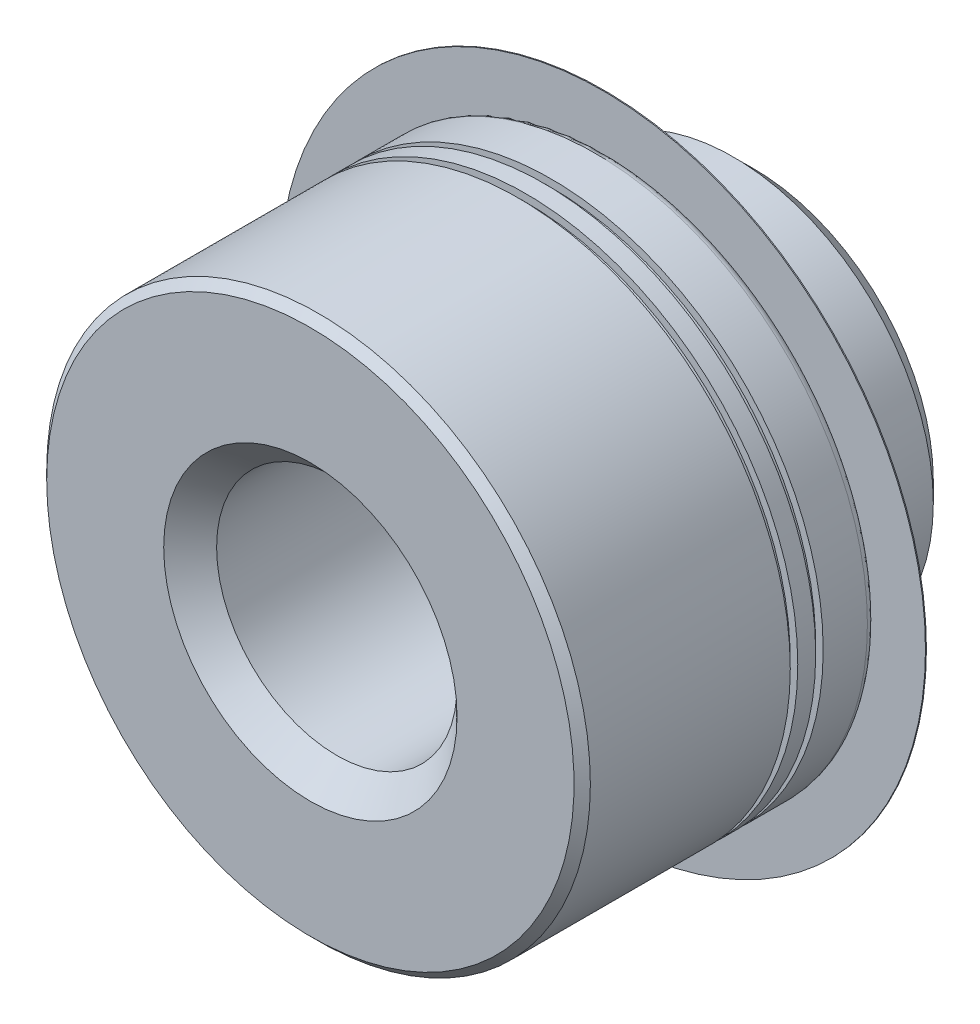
ISO-10303-21;
HEADER;
FILE_DESCRIPTION(('STEP AP214'),'2;1');
FILE_NAME('part.step','',(''),(''),'','','');
FILE_SCHEMA(('AUTOMOTIVE_DESIGN { 1 0 10303 214 1 1 1 1 }'));
ENDSEC;
DATA;
#1=APPLICATION_CONTEXT('core data for automotive mechanical design processes');
#2=APPLICATION_PROTOCOL_DEFINITION('international standard','automotive_design',2000,#1);
#3=PRODUCT_CONTEXT('',#1,'mechanical');
#4=PRODUCT('Part','Part','',(#3));
#5=PRODUCT_RELATED_PRODUCT_CATEGORY('part','',(#4));
#6=PRODUCT_DEFINITION_FORMATION('','',#4);
#7=PRODUCT_DEFINITION_CONTEXT('part definition',#1,'design');
#8=PRODUCT_DEFINITION('design','',#6,#7);
#9=PRODUCT_DEFINITION_SHAPE('','',#8);
#10=(LENGTH_UNIT() NAMED_UNIT(*) SI_UNIT(.MILLI.,.METRE.));
#11=(NAMED_UNIT(*) PLANE_ANGLE_UNIT() SI_UNIT($,.RADIAN.));
#12=(NAMED_UNIT(*) SI_UNIT($,.STERADIAN.) SOLID_ANGLE_UNIT());
#13=UNCERTAINTY_MEASURE_WITH_UNIT(LENGTH_MEASURE(1.E-05),#10,'distance_accuracy_value','');
#14=(GEOMETRIC_REPRESENTATION_CONTEXT(3) GLOBAL_UNCERTAINTY_ASSIGNED_CONTEXT((#13)) GLOBAL_UNIT_ASSIGNED_CONTEXT((#10,
#11,#12)) REPRESENTATION_CONTEXT('',''));
#15=CARTESIAN_POINT('',(0.,0.,0.));
#16=DIRECTION('',(0.,0.,1.));
#17=DIRECTION('',(1.,0.,0.));
#18=AXIS2_PLACEMENT_3D('',#15,#16,#17);
#19=CARTESIAN_POINT('',(0.,0.,0.833849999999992));
#20=DIRECTION('',(0.,0.,-1.));
#21=DIRECTION('',(-1.,0.,0.));
#22=AXIS2_PLACEMENT_3D('',#19,#20,#21);
#23=CYLINDRICAL_SURFACE('',#22,2.7034999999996);
#24=CARTESIAN_POINT('',(0.,0.,0.795600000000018));
#25=DIRECTION('',(0.,0.,-1.));
#26=DIRECTION('',(-1.,0.,0.));
#27=AXIS2_PLACEMENT_3D('',#24,#25,#26);
#28=CIRCLE('',#27,2.7034999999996);
#29=CARTESIAN_POINT('',(-2.7034999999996,0.,0.795600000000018));
#30=VERTEX_POINT('',#29);
#31=EDGE_CURVE('E70',#30,#30,#28,.T.);
#32=ORIENTED_EDGE('',*,*,#31,.F.);
#33=EDGE_LOOP('',(#32));
#34=FACE_BOUND('',#33,.T.);
#35=CARTESIAN_POINT('',(0.,0.,0.872099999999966));
#36=DIRECTION('',(0.,0.,-1.));
#37=DIRECTION('',(-1.,0.,0.));
#38=AXIS2_PLACEMENT_3D('',#35,#36,#37);
#39=CIRCLE('',#38,2.7034999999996);
#40=CARTESIAN_POINT('',(-2.7034999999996,0.,0.872099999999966));
#41=VERTEX_POINT('',#40);
#42=EDGE_CURVE('E17',#41,#41,#39,.F.);
#43=ORIENTED_EDGE('',*,*,#42,.F.);
#44=EDGE_LOOP('',(#43));
#45=FACE_BOUND('',#44,.T.);
#46=ADVANCED_FACE('F14',(#34,#45),#23,.T.);
#47=CARTESIAN_POINT('',(2.74174999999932,0.,0.872099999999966));
#48=DIRECTION('',(0.,0.,-1.));
#49=DIRECTION('',(-1.,0.,0.));
#50=AXIS2_PLACEMENT_3D('',#47,#48,#49);
#51=PLANE('',#50);
#52=ORIENTED_EDGE('',*,*,#42,.T.);
#53=EDGE_LOOP('',(#52));
#54=FACE_BOUND('',#53,.T.);
#55=CARTESIAN_POINT('',(0.,0.,0.872099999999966));
#56=DIRECTION('',(0.,0.,-1.));
#57=DIRECTION('',(-1.,0.,0.));
#58=AXIS2_PLACEMENT_3D('',#55,#56,#57);
#59=CIRCLE('',#58,2.77999999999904);
#60=CARTESIAN_POINT('',(-2.77999999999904,0.,0.872099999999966));
#61=VERTEX_POINT('',#60);
#62=EDGE_CURVE('E68',#61,#61,#59,.F.);
#63=ORIENTED_EDGE('',*,*,#62,.F.);
#64=EDGE_LOOP('',(#63));
#65=FACE_BOUND('',#64,.T.);
#66=ADVANCED_FACE('F77',(#54,#65),#51,.T.);
#67=CARTESIAN_POINT('',(2.74174999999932,0.,0.795600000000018));
#68=DIRECTION('',(0.,0.,1.));
#69=DIRECTION('',(1.,0.,0.));
#70=AXIS2_PLACEMENT_3D('',#67,#68,#69);
#71=PLANE('',#70);
#72=ORIENTED_EDGE('',*,*,#31,.T.);
#73=EDGE_LOOP('',(#72));
#74=FACE_BOUND('',#73,.T.);
#75=CARTESIAN_POINT('',(0.,0.,0.795600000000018));
#76=DIRECTION('',(0.,0.,-1.));
#77=DIRECTION('',(-1.,0.,0.));
#78=AXIS2_PLACEMENT_3D('',#75,#76,#77);
#79=CIRCLE('',#78,2.77999999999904);
#80=CARTESIAN_POINT('',(-2.77999999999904,0.,0.795600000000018));
#81=VERTEX_POINT('',#80);
#82=EDGE_CURVE('E65',#81,#81,#79,.T.);
#83=ORIENTED_EDGE('',*,*,#82,.F.);
#84=EDGE_LOOP('',(#83));
#85=FACE_BOUND('',#84,.T.);
#86=ADVANCED_FACE('F86',(#74,#85),#71,.T.);
#87=CARTESIAN_POINT('',(0.,0.,1.89435000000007));
#88=DIRECTION('',(0.,0.,-1.));
#89=DIRECTION('',(-1.,0.,0.));
#90=AXIS2_PLACEMENT_3D('',#87,#88,#89);
#91=CYLINDRICAL_SURFACE('',#90,2.77999999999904);
#92=ORIENTED_EDGE('',*,*,#62,.T.);
#93=EDGE_LOOP('',(#92));
#94=FACE_BOUND('',#93,.T.);
#95=CARTESIAN_POINT('',(0.,0.,2.91660000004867));
#96=DIRECTION('',(0.,0.,-1.));
#97=DIRECTION('',(1.,0.,0.));
#98=AXIS2_PLACEMENT_3D('',#95,#96,#97);
#99=CIRCLE('',#98,2.77999999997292);
#100=CARTESIAN_POINT('',(2.77999999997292,0.,2.91660000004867));
#101=VERTEX_POINT('',#100);
#102=EDGE_CURVE('E29',#101,#101,#99,.F.);
#103=ORIENTED_EDGE('',*,*,#102,.F.);
#104=EDGE_LOOP('',(#103));
#105=FACE_BOUND('',#104,.T.);
#106=ADVANCED_FACE('F182',(#94,#105),#91,.T.);
#107=CARTESIAN_POINT('',(0.,0.,0.703799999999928));
#108=DIRECTION('',(0.,0.,-1.));
#109=DIRECTION('',(-1.,0.,0.));
#110=AXIS2_PLACEMENT_3D('',#107,#108,#109);
#111=CYLINDRICAL_SURFACE('',#110,2.77999999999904);
#112=CARTESIAN_POINT('',(0.,0.,0.612000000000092));
#113=DIRECTION('',(0.,0.,-1.));
#114=DIRECTION('',(-1.,0.,0.));
#115=AXIS2_PLACEMENT_3D('',#112,#113,#114);
#116=CIRCLE('',#115,2.77999999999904);
#117=CARTESIAN_POINT('',(-2.77999999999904,0.,0.612000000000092));
#118=VERTEX_POINT('',#117);
#119=EDGE_CURVE('E62',#118,#118,#116,.T.);
#120=ORIENTED_EDGE('',*,*,#119,.F.);
#121=EDGE_LOOP('',(#120));
#122=FACE_BOUND('',#121,.T.);
#123=ORIENTED_EDGE('',*,*,#82,.T.);
#124=EDGE_LOOP('',(#123));
#125=FACE_BOUND('',#124,.T.);
#126=ADVANCED_FACE('F178',(#122,#125),#111,.T.);
#127=CARTESIAN_POINT('',(0.,0.,2.91660000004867));
#128=DIRECTION('',(0.,0.,-1.));
#129=DIRECTION('',(-1.,0.,0.));
#130=AXIS2_PLACEMENT_3D('',#127,#128,#129);
#131=CONICAL_SURFACE('',#130,2.77999999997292,0.785398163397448);
#132=ORIENTED_EDGE('',*,*,#102,.T.);
#133=EDGE_LOOP('',(#132));
#134=FACE_BOUND('',#133,.T.);
#135=CARTESIAN_POINT('',(0.,0.,2.9999999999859));
#136=DIRECTION('',(0.,0.,-1.));
#137=DIRECTION('',(-1.,0.,0.));
#138=AXIS2_PLACEMENT_3D('',#135,#136,#137);
#139=CIRCLE('',#138,2.69660000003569);
#140=CARTESIAN_POINT('',(-2.69660000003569,0.,2.9999999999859));
#141=VERTEX_POINT('',#140);
#142=EDGE_CURVE('E59',#141,#141,#139,.F.);
#143=ORIENTED_EDGE('',*,*,#142,.F.);
#144=EDGE_LOOP('',(#143));
#145=FACE_BOUND('',#144,.T.);
#146=ADVANCED_FACE('F174',(#134,#145),#131,.T.);
#147=CARTESIAN_POINT('',(2.74174999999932,0.,0.612000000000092));
#148=DIRECTION('',(0.,0.,-1.));
#149=DIRECTION('',(-1.,0.,0.));
#150=AXIS2_PLACEMENT_3D('',#147,#148,#149);
#151=PLANE('',#150);
#152=CARTESIAN_POINT('',(0.,0.,0.612000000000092));
#153=DIRECTION('',(0.,0.,-1.));
#154=DIRECTION('',(-1.,0.,0.));
#155=AXIS2_PLACEMENT_3D('',#152,#153,#154);
#156=CIRCLE('',#155,2.7034999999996);
#157=CARTESIAN_POINT('',(-2.7034999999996,0.,0.612000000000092));
#158=VERTEX_POINT('',#157);
#159=EDGE_CURVE('E56',#158,#158,#156,.T.);
#160=ORIENTED_EDGE('',*,*,#159,.F.);
#161=EDGE_LOOP('',(#160));
#162=FACE_BOUND('',#161,.T.);
#163=ORIENTED_EDGE('',*,*,#119,.T.);
#164=EDGE_LOOP('',(#163));
#165=FACE_BOUND('',#164,.T.);
#166=ADVANCED_FACE('F170',(#162,#165),#151,.T.);
#167=CARTESIAN_POINT('',(1.34829999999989,0.,3.0000000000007));
#168=DIRECTION('',(0.,0.,1.));
#169=DIRECTION('',(1.,0.,0.));
#170=AXIS2_PLACEMENT_3D('',#167,#168,#169);
#171=PLANE('',#170);
#172=CARTESIAN_POINT('',(0.,0.,2.9999999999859));
#173=DIRECTION('',(0.,0.,1.));
#174=DIRECTION('',(0.,-1.,0.));
#175=AXIS2_PLACEMENT_3D('',#172,#173,#174);
#176=CIRCLE('',#175,1.49999999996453);
#177=CARTESIAN_POINT('',(0.,-1.49999999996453,2.9999999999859));
#178=VERTEX_POINT('',#177);
#179=EDGE_CURVE('E53',#178,#178,#176,.F.);
#180=ORIENTED_EDGE('',*,*,#179,.T.);
#181=EDGE_LOOP('',(#180));
#182=FACE_BOUND('',#181,.T.);
#183=ORIENTED_EDGE('',*,*,#142,.T.);
#184=EDGE_LOOP('',(#183));
#185=FACE_BOUND('',#184,.T.);
#186=ADVANCED_FACE('F166',(#182,#185),#171,.T.);
#187=CARTESIAN_POINT('',(0.,0.,0.573750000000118));
#188=DIRECTION('',(0.,0.,-1.));
#189=DIRECTION('',(-1.,0.,0.));
#190=AXIS2_PLACEMENT_3D('',#187,#188,#189);
#191=CYLINDRICAL_SURFACE('',#190,2.7034999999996);
#192=CARTESIAN_POINT('',(0.,0.,0.53549999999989));
#193=DIRECTION('',(0.,0.,-1.));
#194=DIRECTION('',(-1.,0.,0.));
#195=AXIS2_PLACEMENT_3D('',#192,#193,#194);
#196=CIRCLE('',#195,2.7034999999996);
#197=CARTESIAN_POINT('',(-2.7034999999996,0.,0.53549999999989));
#198=VERTEX_POINT('',#197);
#199=EDGE_CURVE('E50',#198,#198,#196,.T.);
#200=ORIENTED_EDGE('',*,*,#199,.F.);
#201=EDGE_LOOP('',(#200));
#202=FACE_BOUND('',#201,.T.);
#203=ORIENTED_EDGE('',*,*,#159,.T.);
#204=EDGE_LOOP('',(#203));
#205=FACE_BOUND('',#204,.T.);
#206=ADVANCED_FACE('F162',(#202,#205),#191,.T.);
#207=CARTESIAN_POINT('',(0.,0.,2.99999999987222));
#208=DIRECTION('',(0.,0.,1.));
#209=DIRECTION('',(0.,-1.,0.));
#210=AXIS2_PLACEMENT_3D('',#207,#208,#209);
#211=CONICAL_SURFACE('',#210,1.49999999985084,0.785398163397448);
#212=ORIENTED_EDGE('',*,*,#179,.F.);
#213=EDGE_LOOP('',(#212));
#214=FACE_BOUND('',#213,.T.);
#215=CARTESIAN_POINT('',(0.,0.,2.72950000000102));
#216=DIRECTION('',(0.,0.,-1.));
#217=DIRECTION('',(-1.,0.,0.));
#218=AXIS2_PLACEMENT_3D('',#215,#216,#217);
#219=CIRCLE('',#218,1.22949999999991);
#220=CARTESIAN_POINT('',(-1.22949999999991,0.,2.72950000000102));
#221=VERTEX_POINT('',#220);
#222=EDGE_CURVE('E49',#221,#221,#219,.T.);
#223=ORIENTED_EDGE('',*,*,#222,.T.);
#224=EDGE_LOOP('',(#223));
#225=FACE_BOUND('',#224,.T.);
#226=ADVANCED_FACE('F130',(#214,#225),#211,.F.);
#227=CARTESIAN_POINT('',(2.74174999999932,0.,0.53549999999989));
#228=DIRECTION('',(0.,0.,1.));
#229=DIRECTION('',(1.,0.,0.));
#230=AXIS2_PLACEMENT_3D('',#227,#228,#229);
#231=PLANE('',#230);
#232=ORIENTED_EDGE('',*,*,#199,.T.);
#233=EDGE_LOOP('',(#232));
#234=FACE_BOUND('',#233,.T.);
#235=CARTESIAN_POINT('',(0.,0.,0.53549999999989));
#236=DIRECTION('',(0.,0.,-1.));
#237=DIRECTION('',(-1.,0.,0.));
#238=AXIS2_PLACEMENT_3D('',#235,#236,#237);
#239=CIRCLE('',#238,2.77999999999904);
#240=CARTESIAN_POINT('',(-2.77999999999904,0.,0.53549999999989));
#241=VERTEX_POINT('',#240);
#242=EDGE_CURVE('E45',#241,#241,#239,.T.);
#243=ORIENTED_EDGE('',*,*,#242,.F.);
#244=EDGE_LOOP('',(#243));
#245=FACE_BOUND('',#244,.T.);
#246=ADVANCED_FACE('F136',(#234,#245),#231,.T.);
#247=CARTESIAN_POINT('',(0.,0.,0.735000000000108));
#248=DIRECTION('',(0.,0.,-1.));
#249=DIRECTION('',(-1.,0.,0.));
#250=AXIS2_PLACEMENT_3D('',#247,#248,#249);
#251=CYLINDRICAL_SURFACE('',#250,1.22949999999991);
#252=ORIENTED_EDGE('',*,*,#222,.F.);
#253=EDGE_LOOP('',(#252));
#254=FACE_BOUND('',#253,.T.);
#255=CARTESIAN_POINT('',(0.,0.,-1.2595000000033));
#256=DIRECTION('',(0.,0.,-1.));
#257=DIRECTION('',(1.,0.,0.));
#258=AXIS2_PLACEMENT_3D('',#255,#256,#257);
#259=CIRCLE('',#258,1.22949999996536);
#260=CARTESIAN_POINT('',(1.22949999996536,0.,-1.2595000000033));
#261=VERTEX_POINT('',#260);
#262=EDGE_CURVE('E48',#261,#261,#259,.T.);
#263=ORIENTED_EDGE('',*,*,#262,.T.);
#264=EDGE_LOOP('',(#263));
#265=FACE_BOUND('',#264,.T.);
#266=ADVANCED_FACE('F132',(#254,#265),#251,.F.);
#267=CARTESIAN_POINT('',(0.,0.,0.309449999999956));
#268=DIRECTION('',(0.,0.,-1.));
#269=DIRECTION('',(-1.,0.,0.));
#270=AXIS2_PLACEMENT_3D('',#267,#268,#269);
#271=CYLINDRICAL_SURFACE('',#270,2.77999999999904);
#272=ORIENTED_EDGE('',*,*,#242,.T.);
#273=EDGE_LOOP('',(#272));
#274=FACE_BOUND('',#273,.T.);
#275=CARTESIAN_POINT('',(0.,0.,0.0833999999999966));
#276=DIRECTION('',(0.,0.,-1.));
#277=DIRECTION('',(-1.,0.,0.));
#278=AXIS2_PLACEMENT_3D('',#275,#276,#277);
#279=CIRCLE('',#278,2.77999999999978);
#280=CARTESIAN_POINT('',(-2.77999999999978,0.,0.0833999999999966));
#281=VERTEX_POINT('',#280);
#282=EDGE_CURVE('E44',#281,#281,#279,.T.);
#283=ORIENTED_EDGE('',*,*,#282,.F.);
#284=EDGE_LOOP('',(#283));
#285=FACE_BOUND('',#284,.T.);
#286=ADVANCED_FACE('F135',(#274,#285),#271,.T.);
#287=CARTESIAN_POINT('',(0.,0.,-1.52999999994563));
#288=DIRECTION('',(0.,0.,-1.));
#289=DIRECTION('',(0.,1.,0.));
#290=AXIS2_PLACEMENT_3D('',#287,#288,#289);
#291=CONICAL_SURFACE('',#290,1.49999999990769,0.785398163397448);
#292=ORIENTED_EDGE('',*,*,#262,.F.);
#293=EDGE_LOOP('',(#292));
#294=FACE_BOUND('',#293,.T.);
#295=CARTESIAN_POINT('',(0.,0.,-1.53000000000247));
#296=DIRECTION('',(0.,0.,-1.));
#297=DIRECTION('',(0.,1.,0.));
#298=AXIS2_PLACEMENT_3D('',#295,#296,#297);
#299=CIRCLE('',#298,1.49999999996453);
#300=CARTESIAN_POINT('',(0.,1.49999999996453,-1.53000000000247));
#301=VERTEX_POINT('',#300);
#302=EDGE_CURVE('E41',#301,#301,#299,.F.);
#303=ORIENTED_EDGE('',*,*,#302,.F.);
#304=EDGE_LOOP('',(#303));
#305=FACE_BOUND('',#304,.T.);
#306=ADVANCED_FACE('F118',(#294,#305),#291,.F.);
#307=CARTESIAN_POINT('',(0.,0.,0.0833999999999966));
#308=DIRECTION('',(0.,0.,-1.));
#309=DIRECTION('',(-1.,0.,0.));
#310=AXIS2_PLACEMENT_3D('',#307,#308,#309);
#311=TOROIDAL_SURFACE('',#310,2.69659999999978,0.0833999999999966);
#312=ORIENTED_EDGE('',*,*,#282,.T.);
#313=EDGE_LOOP('',(#312));
#314=FACE_BOUND('',#313,.T.);
#315=CARTESIAN_POINT('',(0.,0.,0.0100000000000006));
#316=DIRECTION('',(0.,0.,-1.));
#317=DIRECTION('',(-1.,0.,0.));
#318=AXIS2_PLACEMENT_3D('',#315,#316,#317);
#319=CIRCLE('',#318,2.73619797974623);
#320=CARTESIAN_POINT('',(-2.73619797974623,0.,0.0100000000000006));
#321=VERTEX_POINT('',#320);
#322=EDGE_CURVE('E38',#321,#321,#319,.T.);
#323=ORIENTED_EDGE('',*,*,#322,.F.);
#324=EDGE_LOOP('',(#323));
#325=FACE_BOUND('',#324,.T.);
#326=ADVANCED_FACE('F113',(#314,#325),#311,.T.);
#327=CARTESIAN_POINT('',(0.920250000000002,0.,-1.52999999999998));
#328=DIRECTION('',(0.,0.,-1.));
#329=DIRECTION('',(-1.,0.,0.));
#330=AXIS2_PLACEMENT_3D('',#327,#328,#329);
#331=PLANE('',#330);
#332=ORIENTED_EDGE('',*,*,#302,.T.);
#333=EDGE_LOOP('',(#332));
#334=FACE_BOUND('',#333,.T.);
#335=CARTESIAN_POINT('',(0.,0.,-1.53000000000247));
#336=DIRECTION('',(0.,0.,1.));
#337=DIRECTION('',(1.,0.,0.));
#338=AXIS2_PLACEMENT_3D('',#335,#336,#337);
#339=CIRCLE('',#338,1.8404999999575);
#340=CARTESIAN_POINT('',(1.8404999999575,0.,-1.53000000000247));
#341=VERTEX_POINT('',#340);
#342=EDGE_CURVE('E35',#341,#341,#339,.T.);
#343=ORIENTED_EDGE('',*,*,#342,.F.);
#344=EDGE_LOOP('',(#343));
#345=FACE_BOUND('',#344,.T.);
#346=ADVANCED_FACE('F109',(#334,#345),#331,.T.);
#347=CARTESIAN_POINT('',(0.,0.,0.0100000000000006));
#348=DIRECTION('',(0.,0.,1.));
#349=DIRECTION('',(1.,0.,0.));
#350=AXIS2_PLACEMENT_3D('',#347,#348,#349);
#351=PLANE('',#350);
#352=ORIENTED_EDGE('',*,*,#322,.T.);
#353=EDGE_LOOP('',(#352));
#354=FACE_BOUND('',#353,.T.);
#355=CARTESIAN_POINT('',(1.01509902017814E-05,0.,0.0100000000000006));
#356=DIRECTION('',(0.,0.,1.));
#357=DIRECTION('',(1.,0.,0.));
#358=AXIS2_PLACEMENT_3D('',#355,#356,#357);
#359=CIRCLE('',#358,3.30037870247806);
#360=CARTESIAN_POINT('',(3.30038885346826,0.,0.0100000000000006));
#361=VERTEX_POINT('',#360);
#362=EDGE_CURVE('E32',#361,#361,#359,.F.);
#363=ORIENTED_EDGE('',*,*,#362,.F.);
#364=EDGE_LOOP('',(#363));
#365=FACE_BOUND('',#364,.T.);
#366=ADVANCED_FACE('F105',(#354,#365),#351,.T.);
#367=CARTESIAN_POINT('',(0.,0.,-1.3255000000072));
#368=DIRECTION('',(0.,0.,1.));
#369=DIRECTION('',(1.,0.,0.));
#370=AXIS2_PLACEMENT_3D('',#367,#368,#369);
#371=CONICAL_SURFACE('',#370,2.04499999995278,0.785398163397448);
#372=ORIENTED_EDGE('',*,*,#342,.T.);
#373=EDGE_LOOP('',(#372));
#374=FACE_BOUND('',#373,.T.);
#375=CARTESIAN_POINT('',(0.,0.,-1.32550000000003));
#376=DIRECTION('',(0.,0.,-1.));
#377=DIRECTION('',(-1.,0.,0.));
#378=AXIS2_PLACEMENT_3D('',#375,#376,#377);
#379=CIRCLE('',#378,2.04499999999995);
#380=CARTESIAN_POINT('',(-2.04499999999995,0.,-1.32550000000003));
#381=VERTEX_POINT('',#380);
#382=EDGE_CURVE('E26',#381,#381,#379,.F.);
#383=ORIENTED_EDGE('',*,*,#382,.F.);
#384=EDGE_LOOP('',(#383));
#385=FACE_BOUND('',#384,.T.);
#386=ADVANCED_FACE('F101',(#374,#385),#371,.T.);
#387=CARTESIAN_POINT('',(1.01509902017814E-05,0.,0.));
#388=DIRECTION('',(0.,0.,1.));
#389=DIRECTION('',(1.,0.,0.));
#390=AXIS2_PLACEMENT_3D('',#387,#388,#389);
#391=CYLINDRICAL_SURFACE('',#390,3.30037870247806);
#392=ORIENTED_EDGE('',*,*,#362,.T.);
#393=EDGE_LOOP('',(#392));
#394=FACE_BOUND('',#393,.T.);
#395=CARTESIAN_POINT('',(1.01509902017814E-05,0.,0.));
#396=DIRECTION('',(0.,0.,1.));
#397=DIRECTION('',(1.,0.,0.));
#398=AXIS2_PLACEMENT_3D('',#395,#396,#397);
#399=CIRCLE('',#398,3.30037870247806);
#400=CARTESIAN_POINT('',(3.30038885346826,0.,0.));
#401=VERTEX_POINT('',#400);
#402=EDGE_CURVE('E21',#401,#401,#399,.F.);
#403=ORIENTED_EDGE('',*,*,#402,.F.);
#404=EDGE_LOOP('',(#403));
#405=FACE_BOUND('',#404,.T.);
#406=ADVANCED_FACE('F94',(#394,#405),#391,.T.);
#407=CARTESIAN_POINT('',(0.,0.,-0.662750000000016));
#408=DIRECTION('',(0.,0.,-1.));
#409=DIRECTION('',(-1.,0.,0.));
#410=AXIS2_PLACEMENT_3D('',#407,#408,#409);
#411=CYLINDRICAL_SURFACE('',#410,2.04499999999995);
#412=ORIENTED_EDGE('',*,*,#382,.T.);
#413=EDGE_LOOP('',(#412));
#414=FACE_BOUND('',#413,.T.);
#415=CARTESIAN_POINT('',(0.,0.,0.));
#416=DIRECTION('',(0.,0.,-1.));
#417=DIRECTION('',(-1.,0.,0.));
#418=AXIS2_PLACEMENT_3D('',#415,#416,#417);
#419=CIRCLE('',#418,2.04499999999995);
#420=CARTESIAN_POINT('',(-2.04499999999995,0.,0.));
#421=VERTEX_POINT('',#420);
#422=EDGE_CURVE('E10',#421,#421,#419,.F.);
#423=ORIENTED_EDGE('',*,*,#422,.F.);
#424=EDGE_LOOP('',(#423));
#425=FACE_BOUND('',#424,.T.);
#426=ADVANCED_FACE('F89',(#414,#425),#411,.T.);
#427=CARTESIAN_POINT('',(2.37080000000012,0.,0.));
#428=DIRECTION('',(0.,0.,-1.));
#429=DIRECTION('',(-1.,0.,0.));
#430=AXIS2_PLACEMENT_3D('',#427,#428,#429);
#431=PLANE('',#430);
#432=ORIENTED_EDGE('',*,*,#422,.T.);
#433=EDGE_LOOP('',(#432));
#434=FACE_BOUND('',#433,.T.);
#435=ORIENTED_EDGE('',*,*,#402,.T.);
#436=EDGE_LOOP('',(#435));
#437=FACE_BOUND('',#436,.T.);
#438=ADVANCED_FACE('F87',(#434,#437),#431,.T.);
#439=CLOSED_SHELL('',(#46,#66,#86,#106,#126,#146,#166,#186,#206,#226,#246,#266,#286,#306,#326,
#346,#366,#386,#406,#426,#438));
#440=MANIFOLD_SOLID_BREP('B1',#439);
#441=ADVANCED_BREP_SHAPE_REPRESENTATION('',(#18,#440),#14);
#442=SHAPE_DEFINITION_REPRESENTATION(#9,#441);
ENDSEC;
END-ISO-10303-21;
